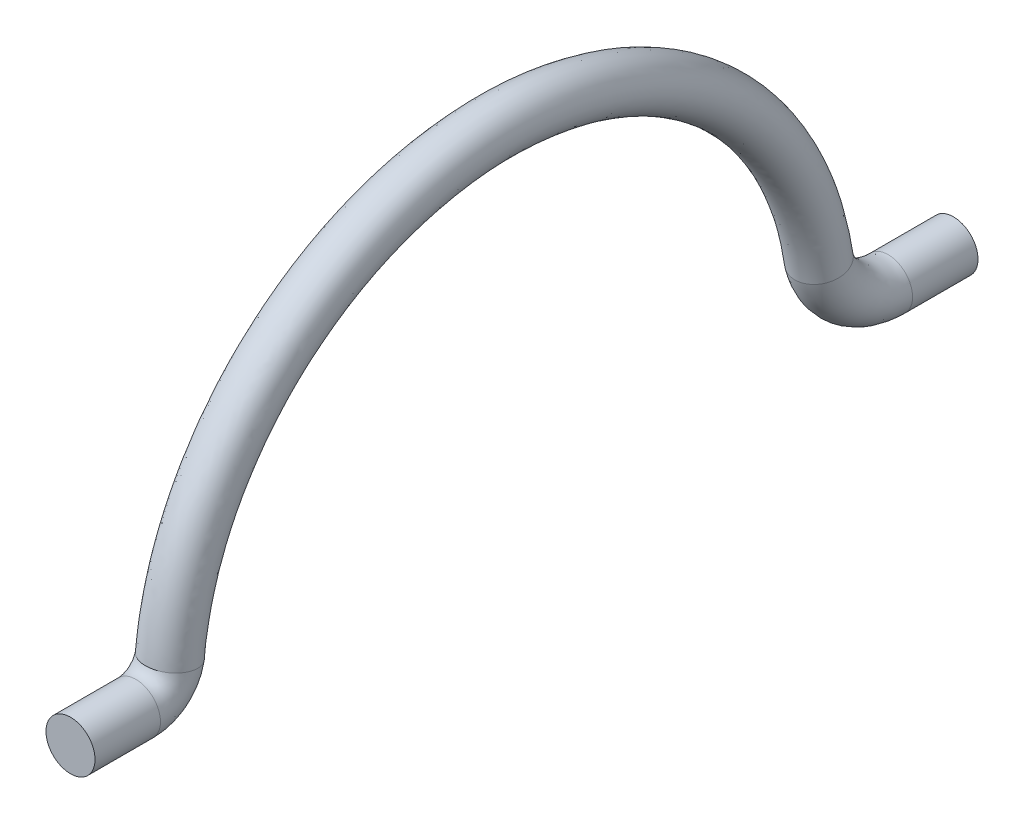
ISO-10303-21;
HEADER;
FILE_DESCRIPTION(('STEP AP214'),'2;1');
FILE_NAME('part.step','',(''),(''),'','','');
FILE_SCHEMA(('AUTOMOTIVE_DESIGN { 1 0 10303 214 1 1 1 1 }'));
ENDSEC;
DATA;
#1=APPLICATION_CONTEXT('core data for automotive mechanical design processes');
#2=APPLICATION_PROTOCOL_DEFINITION('international standard','automotive_design',2000,#1);
#3=PRODUCT_CONTEXT('',#1,'mechanical');
#4=PRODUCT('Part','Part','',(#3));
#5=PRODUCT_RELATED_PRODUCT_CATEGORY('part','',(#4));
#6=PRODUCT_DEFINITION_FORMATION('','',#4);
#7=PRODUCT_DEFINITION_CONTEXT('part definition',#1,'design');
#8=PRODUCT_DEFINITION('design','',#6,#7);
#9=PRODUCT_DEFINITION_SHAPE('','',#8);
#10=(LENGTH_UNIT() NAMED_UNIT(*) SI_UNIT(.MILLI.,.METRE.));
#11=(NAMED_UNIT(*) PLANE_ANGLE_UNIT() SI_UNIT($,.RADIAN.));
#12=(NAMED_UNIT(*) SI_UNIT($,.STERADIAN.) SOLID_ANGLE_UNIT());
#13=UNCERTAINTY_MEASURE_WITH_UNIT(LENGTH_MEASURE(1.E-05),#10,'distance_accuracy_value','');
#14=(GEOMETRIC_REPRESENTATION_CONTEXT(3) GLOBAL_UNCERTAINTY_ASSIGNED_CONTEXT((#13)) GLOBAL_UNIT_ASSIGNED_CONTEXT((#10,
#11,#12)) REPRESENTATION_CONTEXT('',''));
#15=CARTESIAN_POINT('',(0.,0.,0.));
#16=DIRECTION('',(0.,0.,1.));
#17=DIRECTION('',(1.,0.,0.));
#18=AXIS2_PLACEMENT_3D('',#15,#16,#17);
#19=CARTESIAN_POINT('',(0.,7.30249999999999,-29.1980659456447));
#20=DIRECTION('',(0.,0.,-1.));
#21=DIRECTION('',(0.,1.,0.));
#22=AXIS2_PLACEMENT_3D('',#19,#20,#21);
#23=CYLINDRICAL_SURFACE('',#22,0.9525);
#24=CARTESIAN_POINT('',(0.,7.30249999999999,-29.1980659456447));
#25=DIRECTION('',(0.,0.,-1.));
#26=DIRECTION('',(0.,1.,0.));
#27=AXIS2_PLACEMENT_3D('',#24,#25,#26);
#28=CIRCLE('',#27,0.9525);
#29=CARTESIAN_POINT('',(0.,8.25499999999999,-29.1980659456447));
#30=VERTEX_POINT('',#29);
#31=EDGE_CURVE('E80',#30,#30,#28,.T.);
#32=ORIENTED_EDGE('',*,*,#31,.T.);
#33=EDGE_LOOP('',(#32));
#34=FACE_BOUND('',#33,.T.);
#35=CARTESIAN_POINT('',(0.,7.30249999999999,-31.7380659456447));
#36=DIRECTION('',(0.,0.,-1.));
#37=DIRECTION('',(0.,1.,0.));
#38=AXIS2_PLACEMENT_3D('',#35,#36,#37);
#39=CIRCLE('',#38,0.9525);
#40=CARTESIAN_POINT('',(0.,8.25499999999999,-31.7380659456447));
#41=VERTEX_POINT('',#40);
#42=EDGE_CURVE('E11',#41,#41,#39,.T.);
#43=ORIENTED_EDGE('',*,*,#42,.F.);
#44=EDGE_LOOP('',(#43));
#45=FACE_BOUND('',#44,.T.);
#46=ADVANCED_FACE('F66',(#34,#45),#23,.T.);
#47=CARTESIAN_POINT('',(0.9525,7.62,0.));
#48=CARTESIAN_POINT('',(0.9525,7.62451559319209,-0.0809844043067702));
#49=CARTESIAN_POINT('',(0.9525,7.63351499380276,-0.242383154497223));
#50=CARTESIAN_POINT('',(0.9525,7.71050814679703,-0.500961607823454));
#51=CARTESIAN_POINT('',(0.9525,7.83355331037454,-0.741506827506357));
#52=CARTESIAN_POINT('',(0.9525,7.99435949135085,-0.94255544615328));
#53=CARTESIAN_POINT('',(0.9525,8.2086730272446,-1.11857807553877));
#54=CARTESIAN_POINT('',(0.9525,8.45896094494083,-1.25354906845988));
#55=CARTESIAN_POINT('',(0.9525,8.62345074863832,-1.29548803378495));
#56=CARTESIAN_POINT('',(0.9525,8.7058994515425,-1.3165094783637));
#57=CARTESIAN_POINT('',(0.9525,9.525,0.));
#58=CARTESIAN_POINT('',(0.9525,9.52206804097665,0.0453787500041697));
#59=CARTESIAN_POINT('',(0.9525,9.51622476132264,0.13581682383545));
#60=CARTESIAN_POINT('',(0.9525,9.48204204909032,0.229014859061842));
#61=CARTESIAN_POINT('',(0.9525,9.42663593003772,0.330086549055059));
#62=CARTESIAN_POINT('',(0.9525,9.31978870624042,0.448171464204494));
#63=CARTESIAN_POINT('',(0.9525,9.21526287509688,0.514254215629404));
#64=CARTESIAN_POINT('',(0.9525,9.1195492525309,0.552751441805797));
#65=CARTESIAN_POINT('',(0.9525,9.02560417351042,0.564973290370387));
#66=CARTESIAN_POINT('',(0.9525,8.97851523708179,0.571099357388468));
#67=CARTESIAN_POINT('',(-0.9525,9.525,0.));
#68=CARTESIAN_POINT('',(-0.9525,9.52206804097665,0.0453787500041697));
#69=CARTESIAN_POINT('',(-0.9525,9.51622476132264,0.13581682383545));
#70=CARTESIAN_POINT('',(-0.9525,9.48204204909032,0.229014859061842));
#71=CARTESIAN_POINT('',(-0.9525,9.42663593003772,0.330086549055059));
#72=CARTESIAN_POINT('',(-0.9525,9.31978870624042,0.448171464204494));
#73=CARTESIAN_POINT('',(-0.9525,9.21526287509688,0.514254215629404));
#74=CARTESIAN_POINT('',(-0.9525,9.1195492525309,0.552751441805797));
#75=CARTESIAN_POINT('',(-0.9525,9.02560417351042,0.564973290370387));
#76=CARTESIAN_POINT('',(-0.9525,8.97851523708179,0.571099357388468));
#77=CARTESIAN_POINT('',(-0.9525,7.62,0.));
#78=CARTESIAN_POINT('',(-0.9525,7.62451559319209,-0.0809844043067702));
#79=CARTESIAN_POINT('',(-0.9525,7.63351499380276,-0.242383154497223));
#80=CARTESIAN_POINT('',(-0.9525,7.71050814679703,-0.500961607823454));
#81=CARTESIAN_POINT('',(-0.9525,7.83355331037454,-0.741506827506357));
#82=CARTESIAN_POINT('',(-0.9525,7.99435949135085,-0.94255544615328));
#83=CARTESIAN_POINT('',(-0.9525,8.2086730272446,-1.11857807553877));
#84=CARTESIAN_POINT('',(-0.9525,8.45896094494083,-1.25354906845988));
#85=CARTESIAN_POINT('',(-0.9525,8.62345074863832,-1.29548803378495));
#86=CARTESIAN_POINT('',(-0.9525,8.7058994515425,-1.3165094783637));
#87=CARTESIAN_POINT('',(-0.9525,5.715,0.));
#88=CARTESIAN_POINT('',(-0.9525,5.72696314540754,-0.20734755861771));
#89=CARTESIAN_POINT('',(-0.9525,5.75080522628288,-0.620583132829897));
#90=CARTESIAN_POINT('',(-0.9525,5.93897424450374,-1.23093807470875));
#91=CARTESIAN_POINT('',(-0.9525,6.24047069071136,-1.81310020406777));
#92=CARTESIAN_POINT('',(-0.9525,6.66893027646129,-2.33328235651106));
#93=CARTESIAN_POINT('',(-0.9525,7.2020831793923,-2.75141036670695));
#94=CARTESIAN_POINT('',(-0.9525,7.79837263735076,-3.05984957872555));
#95=CARTESIAN_POINT('',(-0.9525,8.2212973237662,-3.1559493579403));
#96=CARTESIAN_POINT('',(-0.9525,8.4332836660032,-3.20411831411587));
#97=CARTESIAN_POINT('',(0.9525,5.715,0.));
#98=CARTESIAN_POINT('',(0.9525,5.72696314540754,-0.20734755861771));
#99=CARTESIAN_POINT('',(0.9525,5.75080522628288,-0.620583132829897));
#100=CARTESIAN_POINT('',(0.9525,5.93897424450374,-1.23093807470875));
#101=CARTESIAN_POINT('',(0.9525,6.24047069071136,-1.81310020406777));
#102=CARTESIAN_POINT('',(0.952500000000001,6.66893027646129,-2.33328235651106));
#103=CARTESIAN_POINT('',(0.9525,7.2020831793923,-2.75141036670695));
#104=CARTESIAN_POINT('',(0.9525,7.79837263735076,-3.05984957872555));
#105=CARTESIAN_POINT('',(0.9525,8.2212973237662,-3.1559493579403));
#106=CARTESIAN_POINT('',(0.9525,8.4332836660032,-3.20411831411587));
#107=CARTESIAN_POINT('',(0.9525,7.62,0.));
#108=CARTESIAN_POINT('',(0.9525,7.62451559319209,-0.0809844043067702));
#109=CARTESIAN_POINT('',(0.9525,7.63351499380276,-0.242383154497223));
#110=CARTESIAN_POINT('',(0.9525,7.71050814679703,-0.500961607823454));
#111=CARTESIAN_POINT('',(0.9525,7.83355331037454,-0.741506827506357));
#112=CARTESIAN_POINT('',(0.9525,7.99435949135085,-0.94255544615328));
#113=CARTESIAN_POINT('',(0.9525,8.2086730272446,-1.11857807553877));
#114=CARTESIAN_POINT('',(0.9525,8.45896094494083,-1.25354906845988));
#115=CARTESIAN_POINT('',(0.9525,8.62345074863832,-1.29548803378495));
#116=CARTESIAN_POINT('',(0.9525,8.7058994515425,-1.3165094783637));
#117=(BOUNDED_SURFACE() B_SPLINE_SURFACE(3,3,((#47,#48,#49,#50,#51,#52,#53,#54,#55,#56),(#57,
#58,#59,#60,#61,#62,#63,#64,#65,#66),(#67,#68,#69,#70,#71,#72,#73,#74,#75,#76),(#77,#78,#79,#80,
#81,#82,#83,#84,#85,#86),(#87,#88,#89,#90,#91,#92,#93,#94,#95,#96),(#97,#98,#99,#100,#101,#102,
#103,#104,#105,#106),(#107,#108,#109,#110,#111,#112,#113,#114,#115,#116)),.UNSPECIFIED.,.T.,.F.,
.F.) B_SPLINE_SURFACE_WITH_KNOTS((4,3,4),(4,1,1,1,1,1,1,4),(0.,0.5,1.),(0.,0.136696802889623,
0.27243138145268,0.414231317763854,0.564864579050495,0.714475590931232,0.85688403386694,1.),
.UNSPECIFIED.) GEOMETRIC_REPRESENTATION_ITEM() RATIONAL_B_SPLINE_SURFACE(((1.,1.,1.,1.,1.,1.,1.,
1.,1.,1.),(0.333333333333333,0.333333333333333,0.333333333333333,0.333333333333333,
0.333333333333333,0.333333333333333,0.333333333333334,0.333333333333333,0.333333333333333,
0.333333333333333),(0.333333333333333,0.333333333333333,0.333333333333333,0.333333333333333,
0.333333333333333,0.333333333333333,0.333333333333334,0.333333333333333,0.333333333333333,
0.333333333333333),(1.,1.,1.,1.,1.,1.,1.,1.,1.,1.),(0.333333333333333,0.333333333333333,
0.333333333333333,0.333333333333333,0.333333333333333,0.333333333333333,0.333333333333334,
0.333333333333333,0.333333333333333,0.333333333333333),(0.333333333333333,0.333333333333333,
0.333333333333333,0.333333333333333,0.333333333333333,0.333333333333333,0.333333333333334,
0.333333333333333,0.333333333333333,0.333333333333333),(1.,1.,1.,1.,1.,1.,1.,1.,1.,1.))) REPRESENTATION_ITEM('') SURFACE());
#118=CARTESIAN_POINT('',(0.,7.62,0.));
#119=DIRECTION('',(0.,0.,1.));
#120=DIRECTION('',(1.,0.,0.));
#121=AXIS2_PLACEMENT_3D('',#118,#119,#120);
#122=CIRCLE('',#121,0.9525);
#123=CARTESIAN_POINT('',(0.9525,7.62,0.));
#124=VERTEX_POINT('',#123);
#125=EDGE_CURVE('E72',#124,#124,#122,.T.);
#126=CARTESIAN_POINT('',(0.9525,8.7058994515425,-1.3165094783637));
#127=CARTESIAN_POINT('',(0.9525,8.97851523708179,0.571099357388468));
#128=CARTESIAN_POINT('',(-0.9525,8.97851523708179,0.571099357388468));
#129=CARTESIAN_POINT('',(-0.9525,8.7058994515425,-1.3165094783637));
#130=CARTESIAN_POINT('',(-0.9525,8.4332836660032,-3.20411831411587));
#131=CARTESIAN_POINT('',(0.9525,8.4332836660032,-3.20411831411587));
#132=CARTESIAN_POINT('',(0.9525,8.7058994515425,-1.3165094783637));
#133=(BOUNDED_CURVE() B_SPLINE_CURVE(3,(#126,#127,#128,#129,#130,#131,#132),.UNSPECIFIED.,.T.,
.F.) B_SPLINE_CURVE_WITH_KNOTS((4,3,4),(0.,0.5,1.),
.UNSPECIFIED.) CURVE() GEOMETRIC_REPRESENTATION_ITEM() RATIONAL_B_SPLINE_CURVE((1.,
0.333333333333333,0.333333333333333,1.,0.333333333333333,0.333333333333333,1.)) REPRESENTATION_ITEM(''));
#134=CARTESIAN_POINT('',(0.9525,8.7058994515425,-1.3165094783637));
#135=VERTEX_POINT('',#134);
#136=EDGE_CURVE('E76',#135,#135,#133,.F.);
#137=ORIENTED_EDGE('',*,*,#125,.F.);
#138=EDGE_LOOP('',(#137));
#139=FACE_BOUND('',#138,.T.);
#140=ORIENTED_EDGE('',*,*,#136,.F.);
#141=EDGE_LOOP('',(#140));
#142=FACE_BOUND('',#141,.T.);
#143=ADVANCED_FACE('F117',(#139,#142),#117,.F.);
#144=CARTESIAN_POINT('',(0.9525,8.70589945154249,-1.3165094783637));
#145=CARTESIAN_POINT('',(0.9525,9.25818543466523,-1.36939606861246));
#146=CARTESIAN_POINT('',(0.9525,10.4182616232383,-1.55698465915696));
#147=CARTESIAN_POINT('',(0.9525,12.1959499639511,-2.10690689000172));
#148=CARTESIAN_POINT('',(0.9525,14.0450995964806,-3.00739375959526));
#149=CARTESIAN_POINT('',(0.9525,15.879114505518,-4.32191768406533));
#150=CARTESIAN_POINT('',(0.9525,17.5653453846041,-6.08865235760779));
#151=CARTESIAN_POINT('',(0.9525,18.9655656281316,-8.28660744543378));
#152=CARTESIAN_POINT('',(0.9525,19.9044893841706,-10.8443047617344));
#153=CARTESIAN_POINT('',(0.9525,20.296543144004,-13.6062245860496));
#154=CARTESIAN_POINT('',(0.9525,20.057054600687,-16.3855326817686));
#155=CARTESIAN_POINT('',(0.9525,19.2602874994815,-18.9910181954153));
#156=CARTESIAN_POINT('',(0.9525,17.9831282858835,-21.2626890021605));
#157=CARTESIAN_POINT('',(0.9525,16.3966644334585,-23.1195299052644));
#158=CARTESIAN_POINT('',(0.9525,14.637758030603,-24.532976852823));
#159=CARTESIAN_POINT('',(0.9525,12.8409579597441,-25.5338467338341));
#160=CARTESIAN_POINT('',(0.9525,11.0962215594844,-26.1807509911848));
#161=CARTESIAN_POINT('',(0.9525,9.94822456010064,-26.4318871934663));
#162=CARTESIAN_POINT('',(0.9525,9.39968528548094,-26.5150825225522));
#163=CARTESIAN_POINT('',(0.9525,8.4332836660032,-3.20411831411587));
#164=CARTESIAN_POINT('',(0.9525,8.98556964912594,-3.25700490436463));
#165=CARTESIAN_POINT('',(0.9525,9.86198342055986,-3.39241420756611));
#166=CARTESIAN_POINT('',(0.9525,11.4398913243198,-3.86069807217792));
#167=CARTESIAN_POINT('',(0.9525,13.0100238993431,-4.61970700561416));
#168=CARTESIAN_POINT('',(0.9525,14.5884046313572,-5.73666528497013));
#169=CARTESIAN_POINT('',(0.9525,16.0333344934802,-7.24162127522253));
#170=CARTESIAN_POINT('',(0.9525,17.2356239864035,-9.11565856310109));
#171=CARTESIAN_POINT('',(0.9525,18.0399258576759,-11.2994994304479));
#172=CARTESIAN_POINT('',(0.952500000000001,18.3776292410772,-13.6578240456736));
#173=CARTESIAN_POINT('',(0.9525,18.1707370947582,-16.0312019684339));
#174=CARTESIAN_POINT('',(0.952500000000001,17.4883183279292,-18.2561450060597));
#175=CARTESIAN_POINT('',(0.9525,16.3914054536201,-20.1937421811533));
#176=CARTESIAN_POINT('',(0.952500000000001,15.0318307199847,-21.7762313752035));
#177=CARTESIAN_POINT('',(0.952500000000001,13.5175728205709,-22.9786779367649));
#178=CARTESIAN_POINT('',(0.952500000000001,11.9917794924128,-23.8232995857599));
#179=CARTESIAN_POINT('',(0.952500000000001,10.4421434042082,-24.3779614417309));
#180=CARTESIAN_POINT('',(0.952500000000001,9.57458249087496,-24.5617706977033));
#181=CARTESIAN_POINT('',(0.952500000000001,9.02604321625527,-24.6449660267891));
#182=CARTESIAN_POINT('',(-0.9525,8.4332836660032,-3.20411831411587));
#183=CARTESIAN_POINT('',(-0.9525,8.98556964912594,-3.25700490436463));
#184=CARTESIAN_POINT('',(-0.952499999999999,9.86198342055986,-3.39241420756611));
#185=CARTESIAN_POINT('',(-0.952500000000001,11.4398913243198,-3.86069807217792));
#186=CARTESIAN_POINT('',(-0.9525,13.0100238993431,-4.61970700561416));
#187=CARTESIAN_POINT('',(-0.9525,14.5884046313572,-5.73666528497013));
#188=CARTESIAN_POINT('',(-0.9525,16.0333344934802,-7.24162127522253));
#189=CARTESIAN_POINT('',(-0.9525,17.2356239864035,-9.11565856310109));
#190=CARTESIAN_POINT('',(-0.9525,18.0399258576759,-11.2994994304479));
#191=CARTESIAN_POINT('',(-0.9525,18.3776292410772,-13.6578240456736));
#192=CARTESIAN_POINT('',(-0.9525,18.1707370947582,-16.0312019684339));
#193=CARTESIAN_POINT('',(-0.9525,17.4883183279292,-18.2561450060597));
#194=CARTESIAN_POINT('',(-0.952499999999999,16.3914054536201,-20.1937421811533));
#195=CARTESIAN_POINT('',(-0.9525,15.0318307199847,-21.7762313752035));
#196=CARTESIAN_POINT('',(-0.952499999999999,13.5175728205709,-22.9786779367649));
#197=CARTESIAN_POINT('',(-0.952499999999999,11.9917794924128,-23.8232995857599));
#198=CARTESIAN_POINT('',(-0.952499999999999,10.4421434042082,-24.3779614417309));
#199=CARTESIAN_POINT('',(-0.952499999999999,9.57458249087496,-24.5617706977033));
#200=CARTESIAN_POINT('',(-0.952499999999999,9.02604321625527,-24.6449660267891));
#201=CARTESIAN_POINT('',(-0.9525,8.70589945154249,-1.3165094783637));
#202=CARTESIAN_POINT('',(-0.9525,9.25818543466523,-1.36939606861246));
#203=CARTESIAN_POINT('',(-0.9525,10.4182616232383,-1.55698465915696));
#204=CARTESIAN_POINT('',(-0.9525,12.1959499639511,-2.10690689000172));
#205=CARTESIAN_POINT('',(-0.9525,14.0450995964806,-3.00739375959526));
#206=CARTESIAN_POINT('',(-0.9525,15.879114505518,-4.32191768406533));
#207=CARTESIAN_POINT('',(-0.9525,17.5653453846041,-6.08865235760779));
#208=CARTESIAN_POINT('',(-0.9525,18.9655656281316,-8.28660744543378));
#209=CARTESIAN_POINT('',(-0.9525,19.9044893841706,-10.8443047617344));
#210=CARTESIAN_POINT('',(-0.9525,20.296543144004,-13.6062245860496));
#211=CARTESIAN_POINT('',(-0.9525,20.057054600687,-16.3855326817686));
#212=CARTESIAN_POINT('',(-0.9525,19.2602874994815,-18.9910181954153));
#213=CARTESIAN_POINT('',(-0.9525,17.9831282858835,-21.2626890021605));
#214=CARTESIAN_POINT('',(-0.9525,16.3966644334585,-23.1195299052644));
#215=CARTESIAN_POINT('',(-0.9525,14.637758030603,-24.532976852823));
#216=CARTESIAN_POINT('',(-0.9525,12.8409579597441,-25.5338467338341));
#217=CARTESIAN_POINT('',(-0.9525,11.0962215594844,-26.1807509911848));
#218=CARTESIAN_POINT('',(-0.9525,9.94822456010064,-26.4318871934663));
#219=CARTESIAN_POINT('',(-0.9525,9.39968528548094,-26.5150825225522));
#220=CARTESIAN_POINT('',(-0.9525,8.97851523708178,0.571099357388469));
#221=CARTESIAN_POINT('',(-0.9525,9.53080122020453,0.518212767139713));
#222=CARTESIAN_POINT('',(-0.9525,10.9745398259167,0.278444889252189));
#223=CARTESIAN_POINT('',(-0.9525,12.9520086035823,-0.353115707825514));
#224=CARTESIAN_POINT('',(-0.9525,15.0801752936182,-1.39508051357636));
#225=CARTESIAN_POINT('',(-0.952499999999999,17.1698243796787,-2.90717008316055));
#226=CARTESIAN_POINT('',(-0.9525,19.0973562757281,-4.93568343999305));
#227=CARTESIAN_POINT('',(-0.952499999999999,20.6955072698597,-7.45755632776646));
#228=CARTESIAN_POINT('',(-0.9525,21.7690529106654,-10.389110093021));
#229=CARTESIAN_POINT('',(-0.9525,22.2154570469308,-13.5546251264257));
#230=CARTESIAN_POINT('',(-0.9525,21.9433721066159,-16.7398633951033));
#231=CARTESIAN_POINT('',(-0.9525,21.0322566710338,-19.7258913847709));
#232=CARTESIAN_POINT('',(-0.9525,19.5748511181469,-22.3316358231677));
#233=CARTESIAN_POINT('',(-0.952500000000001,17.7614981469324,-24.4628284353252));
#234=CARTESIAN_POINT('',(-0.9525,15.7579432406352,-26.0872757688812));
#235=CARTESIAN_POINT('',(-0.952500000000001,13.6901364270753,-27.2443938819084));
#236=CARTESIAN_POINT('',(-0.9525,11.7502997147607,-27.9835405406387));
#237=CARTESIAN_POINT('',(-0.952500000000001,10.3218666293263,-28.3020036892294));
#238=CARTESIAN_POINT('',(-0.952500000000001,9.77332735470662,-28.3851990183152));
#239=CARTESIAN_POINT('',(0.9525,8.97851523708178,0.571099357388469));
#240=CARTESIAN_POINT('',(0.9525,9.53080122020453,0.518212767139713));
#241=CARTESIAN_POINT('',(0.952499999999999,10.9745398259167,0.278444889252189));
#242=CARTESIAN_POINT('',(0.9525,12.9520086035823,-0.353115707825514));
#243=CARTESIAN_POINT('',(0.9525,15.0801752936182,-1.39508051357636));
#244=CARTESIAN_POINT('',(0.9525,17.1698243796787,-2.90717008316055));
#245=CARTESIAN_POINT('',(0.9525,19.0973562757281,-4.93568343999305));
#246=CARTESIAN_POINT('',(0.9525,20.6955072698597,-7.45755632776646));
#247=CARTESIAN_POINT('',(0.9525,21.7690529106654,-10.389110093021));
#248=CARTESIAN_POINT('',(0.9525,22.2154570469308,-13.5546251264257));
#249=CARTESIAN_POINT('',(0.9525,21.9433721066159,-16.7398633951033));
#250=CARTESIAN_POINT('',(0.952499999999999,21.0322566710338,-19.7258913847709));
#251=CARTESIAN_POINT('',(0.952499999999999,19.5748511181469,-22.3316358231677));
#252=CARTESIAN_POINT('',(0.9525,17.7614981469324,-24.4628284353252));
#253=CARTESIAN_POINT('',(0.952499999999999,15.7579432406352,-26.0872757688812));
#254=CARTESIAN_POINT('',(0.952499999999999,13.6901364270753,-27.2443938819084));
#255=CARTESIAN_POINT('',(0.952499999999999,11.7502997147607,-27.9835405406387));
#256=CARTESIAN_POINT('',(0.952499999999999,10.3218666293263,-28.3020036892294));
#257=CARTESIAN_POINT('',(0.952499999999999,9.77332735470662,-28.3851990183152));
#258=CARTESIAN_POINT('',(0.9525,8.70589945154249,-1.3165094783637));
#259=CARTESIAN_POINT('',(0.9525,9.25818543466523,-1.36939606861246));
#260=CARTESIAN_POINT('',(0.9525,10.4182616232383,-1.55698465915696));
#261=CARTESIAN_POINT('',(0.9525,12.1959499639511,-2.10690689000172));
#262=CARTESIAN_POINT('',(0.9525,14.0450995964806,-3.00739375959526));
#263=CARTESIAN_POINT('',(0.9525,15.879114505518,-4.32191768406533));
#264=CARTESIAN_POINT('',(0.9525,17.5653453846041,-6.08865235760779));
#265=CARTESIAN_POINT('',(0.9525,18.9655656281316,-8.28660744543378));
#266=CARTESIAN_POINT('',(0.9525,19.9044893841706,-10.8443047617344));
#267=CARTESIAN_POINT('',(0.9525,20.296543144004,-13.6062245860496));
#268=CARTESIAN_POINT('',(0.9525,20.057054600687,-16.3855326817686));
#269=CARTESIAN_POINT('',(0.9525,19.2602874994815,-18.9910181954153));
#270=CARTESIAN_POINT('',(0.9525,17.9831282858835,-21.2626890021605));
#271=CARTESIAN_POINT('',(0.9525,16.3966644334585,-23.1195299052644));
#272=CARTESIAN_POINT('',(0.9525,14.637758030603,-24.532976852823));
#273=CARTESIAN_POINT('',(0.9525,12.8409579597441,-25.5338467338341));
#274=CARTESIAN_POINT('',(0.9525,11.0962215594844,-26.1807509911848));
#275=CARTESIAN_POINT('',(0.9525,9.94822456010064,-26.4318871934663));
#276=CARTESIAN_POINT('',(0.9525,9.39968528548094,-26.5150825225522));
#277=(BOUNDED_SURFACE() B_SPLINE_SURFACE(3,3,((#144,#145,#146,#147,#148,#149,#150,#151,#152,
#153,#154,#155,#156,#157,#158,#159,#160,#161,#162),(#163,#164,#165,#166,#167,#168,#169,#170,
#171,#172,#173,#174,#175,#176,#177,#178,#179,#180,#181),(#182,#183,#184,#185,#186,#187,#188,
#189,#190,#191,#192,#193,#194,#195,#196,#197,#198,#199,#200),(#201,#202,#203,#204,#205,#206,
#207,#208,#209,#210,#211,#212,#213,#214,#215,#216,#217,#218,#219),(#220,#221,#222,#223,#224,
#225,#226,#227,#228,#229,#230,#231,#232,#233,#234,#235,#236,#237,#238),(#239,#240,#241,#242,
#243,#244,#245,#246,#247,#248,#249,#250,#251,#252,#253,#254,#255,#256,#257),(#258,#259,#260,
#261,#262,#263,#264,#265,#266,#267,#268,#269,#270,#271,#272,#273,#274,#275,#276)),.UNSPECIFIED.,
.T.,.F.,.F.) B_SPLINE_SURFACE_WITH_KNOTS((4,3,4),(4,1,1,1,1,1,1,1,1,1,1,1,1,1,1,1,4),(0.,0.5,
1.),(0.,0.0453310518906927,0.0956962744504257,0.151512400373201,0.212655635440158,
0.279077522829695,0.349856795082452,0.424064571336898,0.500000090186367,0.575935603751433,
0.650143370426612,0.720922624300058,0.787344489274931,0.848487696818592,0.90430379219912,
0.954668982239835,1.),
.UNSPECIFIED.) GEOMETRIC_REPRESENTATION_ITEM() RATIONAL_B_SPLINE_SURFACE(((1.,1.,1.,1.,1.,1.,1.,
1.,1.,1.,1.,1.,1.,1.,1.,1.,1.,1.,1.),(0.333333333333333,0.333333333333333,0.333333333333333,
0.333333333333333,0.333333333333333,0.333333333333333,0.333333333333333,0.333333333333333,
0.333333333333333,0.333333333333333,0.333333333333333,0.333333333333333,0.333333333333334,
0.333333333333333,0.333333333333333,0.333333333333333,0.333333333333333,0.333333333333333,
0.333333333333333),(0.333333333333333,0.333333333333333,0.333333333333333,0.333333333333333,
0.333333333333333,0.333333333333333,0.333333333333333,0.333333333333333,0.333333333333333,
0.333333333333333,0.333333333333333,0.333333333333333,0.333333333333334,0.333333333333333,
0.333333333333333,0.333333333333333,0.333333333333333,0.333333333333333,0.333333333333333),(1.,
1.,1.,1.,1.,1.,1.,1.,1.,1.,1.,1.,1.,1.,1.,1.,1.,1.,1.),(0.333333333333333,0.333333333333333,
0.333333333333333,0.333333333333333,0.333333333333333,0.333333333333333,0.333333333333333,
0.333333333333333,0.333333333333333,0.333333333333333,0.333333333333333,0.333333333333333,
0.333333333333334,0.333333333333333,0.333333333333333,0.333333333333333,0.333333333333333,
0.333333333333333,0.333333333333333),(0.333333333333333,0.333333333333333,0.333333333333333,
0.333333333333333,0.333333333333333,0.333333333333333,0.333333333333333,0.333333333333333,
0.333333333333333,0.333333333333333,0.333333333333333,0.333333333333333,0.333333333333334,
0.333333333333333,0.333333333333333,0.333333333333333,0.333333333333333,0.333333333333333,
0.333333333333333),(1.,1.,1.,1.,1.,1.,1.,1.,1.,1.,1.,1.,1.,1.,1.,1.,1.,1.,1.))) REPRESENTATION_ITEM('') SURFACE());
#278=CARTESIAN_POINT('',(0.9525,9.39968528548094,-26.5150825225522));
#279=CARTESIAN_POINT('',(0.952499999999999,9.77332735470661,-28.3851990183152));
#280=CARTESIAN_POINT('',(-0.952500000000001,9.77332735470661,-28.3851990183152));
#281=CARTESIAN_POINT('',(-0.9525,9.39968528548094,-26.5150825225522));
#282=CARTESIAN_POINT('',(-0.952499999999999,9.02604321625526,-24.6449660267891));
#283=CARTESIAN_POINT('',(0.952500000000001,9.02604321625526,-24.6449660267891));
#284=CARTESIAN_POINT('',(0.9525,9.39968528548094,-26.5150825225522));
#285=(BOUNDED_CURVE() B_SPLINE_CURVE(3,(#278,#279,#280,#281,#282,#283,#284),.UNSPECIFIED.,.T.,
.F.) B_SPLINE_CURVE_WITH_KNOTS((4,3,4),(0.,0.5,1.),
.UNSPECIFIED.) CURVE() GEOMETRIC_REPRESENTATION_ITEM() RATIONAL_B_SPLINE_CURVE((1.,
0.333333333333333,0.333333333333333,1.,0.333333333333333,0.333333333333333,1.)) REPRESENTATION_ITEM(''));
#286=CARTESIAN_POINT('',(0.9525,9.39968528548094,-26.5150825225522));
#287=VERTEX_POINT('',#286);
#288=EDGE_CURVE('E90',#287,#287,#285,.T.);
#289=ORIENTED_EDGE('',*,*,#136,.T.);
#290=EDGE_LOOP('',(#289));
#291=FACE_BOUND('',#290,.T.);
#292=ORIENTED_EDGE('',*,*,#288,.T.);
#293=EDGE_LOOP('',(#292));
#294=FACE_BOUND('',#293,.T.);
#295=ADVANCED_FACE('F122',(#291,#294),#277,.T.);
#296=CARTESIAN_POINT('',(-0.9525,7.30249999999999,-31.7380659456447));
#297=DIRECTION('',(0.,0.,-1.));
#298=DIRECTION('',(0.,1.,0.));
#299=AXIS2_PLACEMENT_3D('',#296,#297,#298);
#300=PLANE('',#299);
#301=ORIENTED_EDGE('',*,*,#42,.T.);
#302=EDGE_LOOP('',(#301));
#303=FACE_BOUND('',#302,.T.);
#304=ADVANCED_FACE('F113',(#303),#300,.T.);
#305=CARTESIAN_POINT('',(0.9525,9.39968528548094,-26.5150825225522));
#306=CARTESIAN_POINT('',(0.9525,9.24108251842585,-26.5545479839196));
#307=CARTESIAN_POINT('',(0.9525,8.92425763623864,-26.6672367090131));
#308=CARTESIAN_POINT('',(0.9525,8.47965532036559,-26.9202259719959));
#309=CARTESIAN_POINT('',(0.9525,8.07574669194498,-27.2566374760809));
#310=CARTESIAN_POINT('',(0.9525,7.73740531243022,-27.6763463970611));
#311=CARTESIAN_POINT('',(0.9525,7.49014737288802,-28.1602137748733));
#312=CARTESIAN_POINT('',(0.9525,7.33864646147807,-28.6753305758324));
#313=CARTESIAN_POINT('',(0.9525,7.30249999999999,-29.0266587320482));
#314=CARTESIAN_POINT('',(0.9525,7.30249999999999,-29.1980659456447));
#315=CARTESIAN_POINT('',(0.952499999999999,9.77332735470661,-28.3851990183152));
#316=CARTESIAN_POINT('',(0.952499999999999,9.61472458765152,-28.4246644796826));
#317=CARTESIAN_POINT('',(0.952499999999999,9.71912722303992,-28.4259523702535));
#318=CARTESIAN_POINT('',(0.952499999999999,9.5004377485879,-28.5349382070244));
#319=CARTESIAN_POINT('',(0.952499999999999,9.40527066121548,-28.6432735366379));
#320=CARTESIAN_POINT('',(0.952499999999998,9.33184913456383,-28.7491582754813));
#321=CARTESIAN_POINT('',(0.952499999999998,9.26187228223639,-28.8736908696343));
#322=CARTESIAN_POINT('',(0.952499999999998,9.21518106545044,-29.1294963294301));
#323=CARTESIAN_POINT('',(0.952499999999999,9.20749999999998,-29.0266587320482));
#324=CARTESIAN_POINT('',(0.952499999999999,9.20749999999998,-29.1980659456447));
#325=CARTESIAN_POINT('',(-0.952500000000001,9.77332735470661,-28.3851990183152));
#326=CARTESIAN_POINT('',(-0.952500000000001,9.61472458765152,-28.4246644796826));
#327=CARTESIAN_POINT('',(-0.952500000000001,9.71912722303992,-28.4259523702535));
#328=CARTESIAN_POINT('',(-0.952500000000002,9.5004377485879,-28.5349382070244));
#329=CARTESIAN_POINT('',(-0.952500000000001,9.40527066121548,-28.6432735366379));
#330=CARTESIAN_POINT('',(-0.952500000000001,9.33184913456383,-28.7491582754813));
#331=CARTESIAN_POINT('',(-0.952500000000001,9.26187228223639,-28.8736908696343));
#332=CARTESIAN_POINT('',(-0.952500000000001,9.21518106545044,-29.1294963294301));
#333=CARTESIAN_POINT('',(-0.952500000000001,9.20749999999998,-29.0266587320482));
#334=CARTESIAN_POINT('',(-0.952500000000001,9.20749999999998,-29.1980659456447));
#335=CARTESIAN_POINT('',(-0.9525,9.39968528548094,-26.5150825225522));
#336=CARTESIAN_POINT('',(-0.9525,9.24108251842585,-26.5545479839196));
#337=CARTESIAN_POINT('',(-0.9525,8.92425763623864,-26.6672367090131));
#338=CARTESIAN_POINT('',(-0.9525,8.47965532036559,-26.9202259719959));
#339=CARTESIAN_POINT('',(-0.9525,8.07574669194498,-27.2566374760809));
#340=CARTESIAN_POINT('',(-0.9525,7.73740531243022,-27.6763463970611));
#341=CARTESIAN_POINT('',(-0.9525,7.49014737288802,-28.1602137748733));
#342=CARTESIAN_POINT('',(-0.9525,7.33864646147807,-28.6753305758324));
#343=CARTESIAN_POINT('',(-0.9525,7.30249999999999,-29.0266587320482));
#344=CARTESIAN_POINT('',(-0.9525,7.30249999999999,-29.1980659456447));
#345=CARTESIAN_POINT('',(-0.952499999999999,9.02604321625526,-24.6449660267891));
#346=CARTESIAN_POINT('',(-0.952499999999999,8.86744044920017,-24.6844314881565));
#347=CARTESIAN_POINT('',(-0.952499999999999,8.12938804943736,-24.9085210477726));
#348=CARTESIAN_POINT('',(-0.952499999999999,7.45887289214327,-25.3055137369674));
#349=CARTESIAN_POINT('',(-0.952499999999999,6.74622272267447,-25.8700014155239));
#350=CARTESIAN_POINT('',(-0.952499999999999,6.14296149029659,-26.6035345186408));
#351=CARTESIAN_POINT('',(-0.952499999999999,5.71842246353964,-27.4467366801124));
#352=CARTESIAN_POINT('',(-0.952499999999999,5.46211185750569,-28.2211648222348));
#353=CARTESIAN_POINT('',(-0.952499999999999,5.39749999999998,-29.0266587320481));
#354=CARTESIAN_POINT('',(-0.952499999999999,5.39749999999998,-29.1980659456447));
#355=CARTESIAN_POINT('',(0.952500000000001,9.02604321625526,-24.6449660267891));
#356=CARTESIAN_POINT('',(0.952500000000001,8.86744044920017,-24.6844314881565));
#357=CARTESIAN_POINT('',(0.952500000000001,8.12938804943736,-24.9085210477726));
#358=CARTESIAN_POINT('',(0.952500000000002,7.45887289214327,-25.3055137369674));
#359=CARTESIAN_POINT('',(0.952500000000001,6.74622272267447,-25.8700014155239));
#360=CARTESIAN_POINT('',(0.952500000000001,6.14296149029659,-26.6035345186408));
#361=CARTESIAN_POINT('',(0.952500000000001,5.71842246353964,-27.4467366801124));
#362=CARTESIAN_POINT('',(0.952500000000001,5.46211185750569,-28.2211648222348));
#363=CARTESIAN_POINT('',(0.952500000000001,5.39749999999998,-29.0266587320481));
#364=CARTESIAN_POINT('',(0.952500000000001,5.39749999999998,-29.1980659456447));
#365=CARTESIAN_POINT('',(0.9525,9.39968528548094,-26.5150825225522));
#366=CARTESIAN_POINT('',(0.9525,9.24108251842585,-26.5545479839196));
#367=CARTESIAN_POINT('',(0.9525,8.92425763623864,-26.6672367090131));
#368=CARTESIAN_POINT('',(0.9525,8.47965532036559,-26.9202259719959));
#369=CARTESIAN_POINT('',(0.9525,8.07574669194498,-27.2566374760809));
#370=CARTESIAN_POINT('',(0.9525,7.73740531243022,-27.6763463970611));
#371=CARTESIAN_POINT('',(0.9525,7.49014737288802,-28.1602137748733));
#372=CARTESIAN_POINT('',(0.9525,7.33864646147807,-28.6753305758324));
#373=CARTESIAN_POINT('',(0.9525,7.30249999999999,-29.0266587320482));
#374=CARTESIAN_POINT('',(0.9525,7.30249999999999,-29.1980659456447));
#375=(BOUNDED_SURFACE() B_SPLINE_SURFACE(3,3,((#305,#306,#307,#308,#309,#310,#311,#312,#313,
#314),(#315,#316,#317,#318,#319,#320,#321,#322,#323,#324),(#325,#326,#327,#328,#329,#330,#331,
#332,#333,#334),(#335,#336,#337,#338,#339,#340,#341,#342,#343,#344),(#345,#346,#347,#348,#349,
#350,#351,#352,#353,#354),(#355,#356,#357,#358,#359,#360,#361,#362,#363,#364),(#365,#366,#367,
#368,#369,#370,#371,#372,#373,#374)),.UNSPECIFIED.,.T.,.F.,.F.) B_SPLINE_SURFACE_WITH_KNOTS((4,
3,4),(4,1,1,1,1,1,1,4),(0.,0.5,1.),(0.,0.13400798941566,0.273936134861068,0.417286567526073,
0.562271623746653,0.712695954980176,0.85955133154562,1.),
.UNSPECIFIED.) GEOMETRIC_REPRESENTATION_ITEM() RATIONAL_B_SPLINE_SURFACE(((1.,1.,1.,1.,1.,1.,1.,
1.,1.,1.),(0.333333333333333,0.333333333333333,0.333333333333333,0.333333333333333,
0.333333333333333,0.333333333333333,0.333333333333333,0.333333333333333,0.333333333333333,
0.333333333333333),(0.333333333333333,0.333333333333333,0.333333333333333,0.333333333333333,
0.333333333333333,0.333333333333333,0.333333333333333,0.333333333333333,0.333333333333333,
0.333333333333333),(1.,1.,1.,1.,1.,1.,1.,1.,1.,1.),(0.333333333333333,0.333333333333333,
0.333333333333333,0.333333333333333,0.333333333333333,0.333333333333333,0.333333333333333,
0.333333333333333,0.333333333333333,0.333333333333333),(0.333333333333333,0.333333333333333,
0.333333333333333,0.333333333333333,0.333333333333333,0.333333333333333,0.333333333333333,
0.333333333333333,0.333333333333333,0.333333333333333),(1.,1.,1.,1.,1.,1.,1.,1.,1.,1.))) REPRESENTATION_ITEM('') SURFACE());
#376=ORIENTED_EDGE('',*,*,#288,.F.);
#377=EDGE_LOOP('',(#376));
#378=FACE_BOUND('',#377,.T.);
#379=ORIENTED_EDGE('',*,*,#31,.F.);
#380=EDGE_LOOP('',(#379));
#381=FACE_BOUND('',#380,.T.);
#382=ADVANCED_FACE('F106',(#378,#381),#375,.F.);
#383=CARTESIAN_POINT('',(0.,7.62,2.54));
#384=DIRECTION('',(0.,0.,-1.));
#385=DIRECTION('',(-1.,0.,0.));
#386=AXIS2_PLACEMENT_3D('',#383,#384,#385);
#387=CYLINDRICAL_SURFACE('',#386,0.9525);
#388=CARTESIAN_POINT('',(0.,7.62,2.54));
#389=DIRECTION('',(0.,0.,1.));
#390=DIRECTION('',(1.,0.,0.));
#391=AXIS2_PLACEMENT_3D('',#388,#389,#390);
#392=CIRCLE('',#391,0.9525);
#393=CARTESIAN_POINT('',(0.9525,7.62,2.54));
#394=VERTEX_POINT('',#393);
#395=EDGE_CURVE('E95',#394,#394,#392,.T.);
#396=ORIENTED_EDGE('',*,*,#395,.F.);
#397=EDGE_LOOP('',(#396));
#398=FACE_BOUND('',#397,.T.);
#399=ORIENTED_EDGE('',*,*,#125,.T.);
#400=EDGE_LOOP('',(#399));
#401=FACE_BOUND('',#400,.T.);
#402=ADVANCED_FACE('F104',(#398,#401),#387,.T.);
#403=CARTESIAN_POINT('',(0.,7.62,2.54));
#404=DIRECTION('',(0.,0.,1.));
#405=DIRECTION('',(1.,0.,0.));
#406=AXIS2_PLACEMENT_3D('',#403,#404,#405);
#407=PLANE('',#406);
#408=ORIENTED_EDGE('',*,*,#395,.T.);
#409=EDGE_LOOP('',(#408));
#410=FACE_BOUND('',#409,.T.);
#411=ADVANCED_FACE('F102',(#410),#407,.T.);
#412=CLOSED_SHELL('',(#46,#143,#295,#304,#382,#402,#411));
#413=MANIFOLD_SOLID_BREP('B2',#412);
#414=ADVANCED_BREP_SHAPE_REPRESENTATION('',(#18,#413),#14);
#415=SHAPE_DEFINITION_REPRESENTATION(#9,#414);
ENDSEC;
END-ISO-10303-21;
